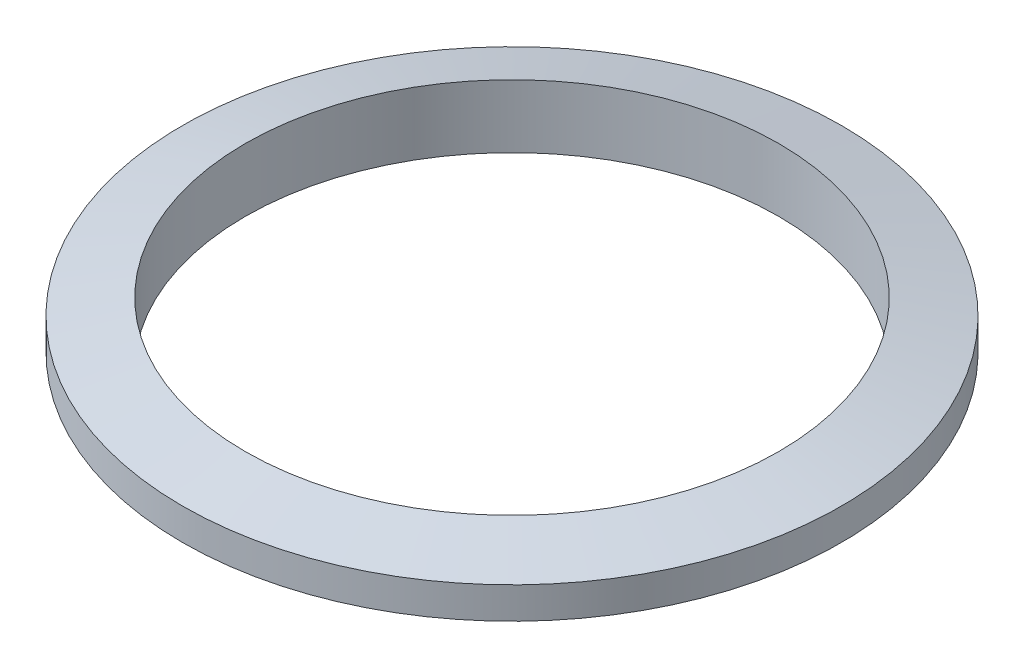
from build123d import *


with BuildPart() as part:
    # Sketch 1 → Revolve 1 (revolve)
    with BuildSketch(Plane.XY, mode=Mode.PRIVATE) as revolve_1_sk:
        Polygon((-11.449252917, -65), (-11.449252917, -67), (-13.437312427, -66.5), (-13.437312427, -65.5), align=None)
    revolve(revolve_1_sk.sketch.rotate(Axis((-3, -69, 0), (0, 1, 0)), 270), axis=Axis((-3, -69, 0), (0, 1, 0)))


solid = part.part
